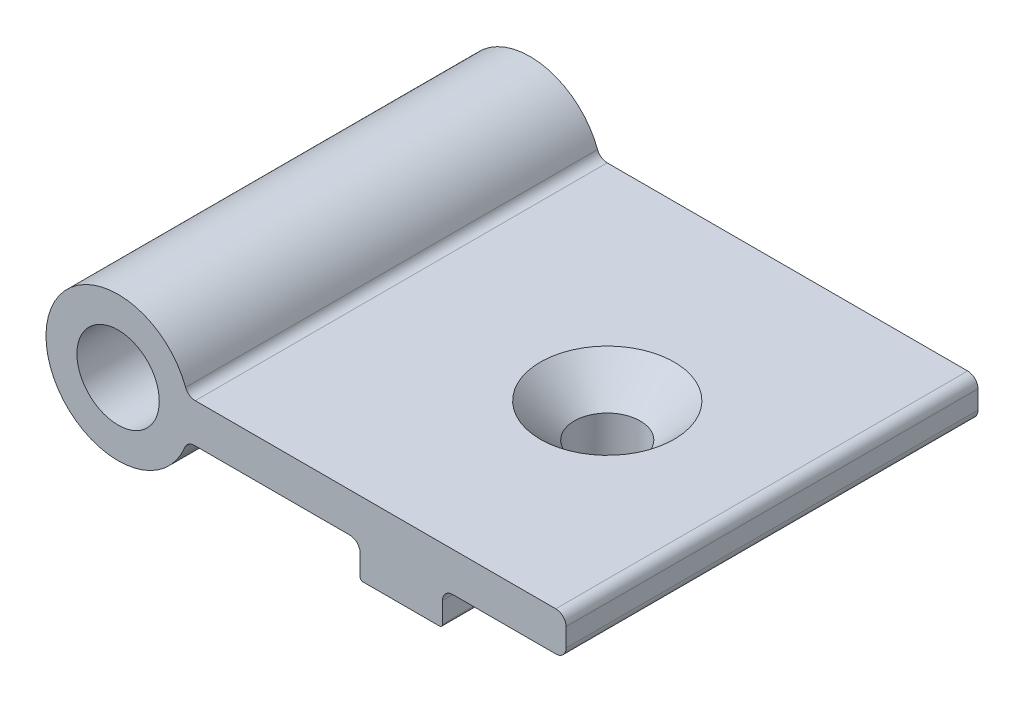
from build123d import *

# Parameters (mm, degrees)
BOSS_EXTRUDE1_DEPTH                             = 40
SKETCH2_W                                       = 8
SKETCH2_H                                       = 40
BOSS_EXTRUDE2_DEPTH                             = 3.3
SKETCH3_W                                       = 40
SKETCH3_H                                       = 3.8
BOSS_EXTRUDE3_DEPTH                             = 12
F_8_0_8_DIAMETER_HOLE1_D                        = 8
CSK_FOR_M6_FLAT_HEAD_MACHINE_SCREW1_D           = 6.4
CSK_FOR_M6_FLAT_HEAD_MACHINE_SCREW1_DEPTH       = 8.8
CSK_FOR_M6_FLAT_HEAD_MACHINE_SCREW1_CSINK_D     = 13
CSK_FOR_M6_FLAT_HEAD_MACHINE_SCREW1_CSINK_ANGLE = 90
FILLET1_R                                       = 0.3
FILLET2_R                                       = 1


with BuildPart() as part:
    # Sketch1 → Boss-Extrude1 (new body)
    with BuildSketch(Plane.XY.offset(62)):
        with BuildLine():
            Line((6.708203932, -2), (31.5, -2))
            Line((31.5, -2), (31.5, 1.8))
            Line((31.5, 1.8), (6.76461381, 1.8))
            ThreePointArc((6.76461381, 1.8), (-6.999228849, 0.103901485), (6.708203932, -2))
        make_face()
    extrude(amount=-BOSS_EXTRUDE1_DEPTH)

    # Sketch2 → Boss-Extrude2 (add)
    with BuildSketch(Plane.XZ.offset(2)):
        with Locations((27.5, 42)):
            Rectangle(SKETCH2_W, SKETCH2_H)
    extrude(amount=BOSS_EXTRUDE2_DEPTH)

    # Sketch3 → Boss-Extrude3 (add)
    with BuildSketch(Plane(origin=(31.5, 0, 0), x_dir=(0, 0, -1), z_dir=(1, 0, 0))):
        with Locations((-42, -0.1)):
            Rectangle(SKETCH3_W, SKETCH3_H)
    extrude(amount=BOSS_EXTRUDE3_DEPTH)

    # 8.0 _8_ Diameter Hole1 (through all)
    with Locations(Plane(origin=(0, 0, 22), x_dir=(-1, 0, 0), z_dir=(0, 0, -1))):
        with Locations((0, 0)):
            Hole(F_8_0_8_DIAMETER_HOLE1_D / 2)

    # CSK for M6 Flat Head Machine Screw1
    with Locations(Plane(origin=(0, 1.8, 0), x_dir=(-1, 0, 0), z_dir=(0, 1, 0))):
        with Locations((-27.5, 42)):
            CounterSinkHole(CSK_FOR_M6_FLAT_HEAD_MACHINE_SCREW1_D / 2, CSK_FOR_M6_FLAT_HEAD_MACHINE_SCREW1_CSINK_D / 2, depth=CSK_FOR_M6_FLAT_HEAD_MACHINE_SCREW1_DEPTH, counter_sink_angle=CSK_FOR_M6_FLAT_HEAD_MACHINE_SCREW1_CSINK_ANGLE)

    # Fillet1
    fillet1_edges = [part.edges().sort_by_distance(p)[0] for p in [
        (31.5, -5.3, 42),
        (23.5, -5.3, 42),
    ]]
    fillet(fillet1_edges, radius=FILLET1_R)

    # Fillet2
    fillet2_edges = [part.edges().sort_by_distance(p)[0] for p in [
        (6.708203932, -2, 42),
        (6.76461381, 1.8, 42),
        (43.5, 1.8, 42),
        (31.5, -2, 42),
        (43.5, -2, 42),
        (23.5, -2, 42),
    ]]
    fillet(fillet2_edges, radius=FILLET2_R)


solid = part.part
